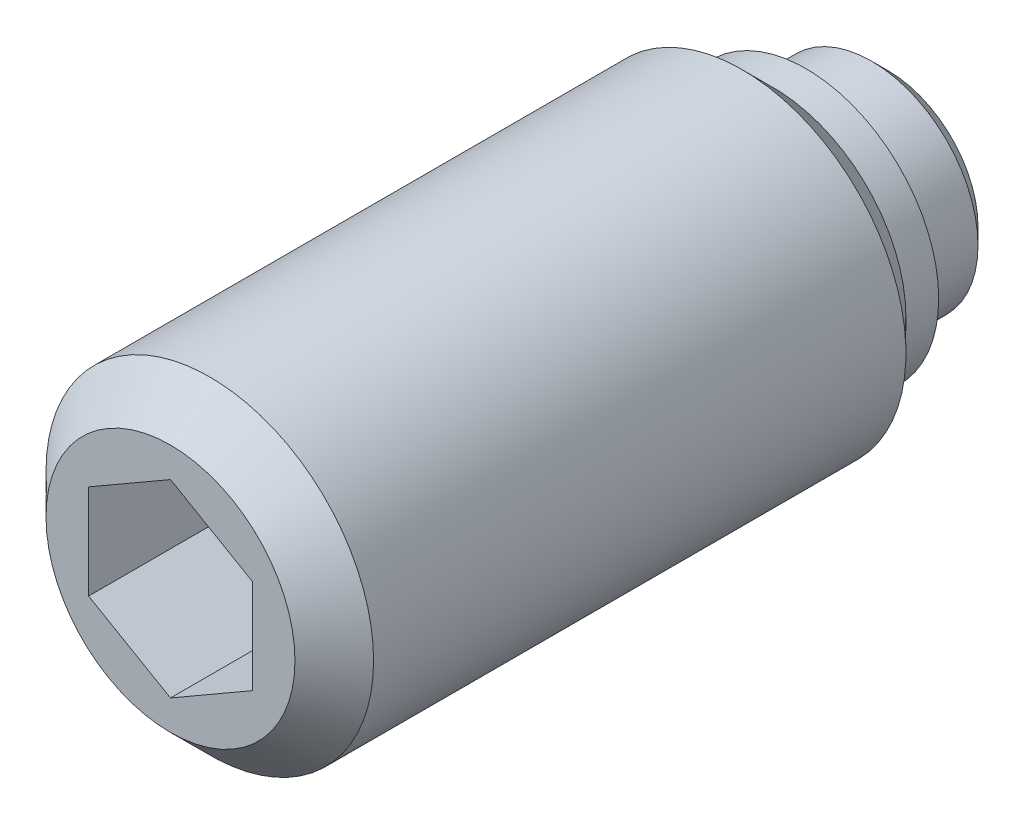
ISO-10303-21;
HEADER;
FILE_DESCRIPTION(('STEP AP214'),'2;1');
FILE_NAME('part.step','',(''),(''),'','','');
FILE_SCHEMA(('AUTOMOTIVE_DESIGN { 1 0 10303 214 1 1 1 1 }'));
ENDSEC;
DATA;
#1=APPLICATION_CONTEXT('core data for automotive mechanical design processes');
#2=APPLICATION_PROTOCOL_DEFINITION('international standard','automotive_design',2000,#1);
#3=PRODUCT_CONTEXT('',#1,'mechanical');
#4=PRODUCT('Part','Part','',(#3));
#5=PRODUCT_RELATED_PRODUCT_CATEGORY('part','',(#4));
#6=PRODUCT_DEFINITION_FORMATION('','',#4);
#7=PRODUCT_DEFINITION_CONTEXT('part definition',#1,'design');
#8=PRODUCT_DEFINITION('design','',#6,#7);
#9=PRODUCT_DEFINITION_SHAPE('','',#8);
#10=(LENGTH_UNIT() NAMED_UNIT(*) SI_UNIT(.MILLI.,.METRE.));
#11=(NAMED_UNIT(*) PLANE_ANGLE_UNIT() SI_UNIT($,.RADIAN.));
#12=(NAMED_UNIT(*) SI_UNIT($,.STERADIAN.) SOLID_ANGLE_UNIT());
#13=UNCERTAINTY_MEASURE_WITH_UNIT(LENGTH_MEASURE(1.E-05),#10,'distance_accuracy_value','');
#14=(GEOMETRIC_REPRESENTATION_CONTEXT(3) GLOBAL_UNCERTAINTY_ASSIGNED_CONTEXT((#13)) GLOBAL_UNIT_ASSIGNED_CONTEXT((#10,
#11,#12)) REPRESENTATION_CONTEXT('',''));
#15=CARTESIAN_POINT('',(0.,0.,0.));
#16=DIRECTION('',(0.,0.,1.));
#17=DIRECTION('',(1.,0.,0.));
#18=AXIS2_PLACEMENT_3D('',#15,#16,#17);
#19=CARTESIAN_POINT('',(0.,0.,0.));
#20=DIRECTION('',(0.,0.,-1.));
#21=DIRECTION('',(-1.,0.,0.));
#22=AXIS2_PLACEMENT_3D('',#19,#20,#21);
#23=CYLINDRICAL_SURFACE('',#22,3.25);
#24=CARTESIAN_POINT('',(0.,0.,0.5));
#25=DIRECTION('',(0.,0.,-1.));
#26=DIRECTION('',(-1.,0.,0.));
#27=AXIS2_PLACEMENT_3D('',#24,#25,#26);
#28=CIRCLE('',#27,3.25);
#29=CARTESIAN_POINT('',(-3.25,0.,0.5));
#30=VERTEX_POINT('',#29);
#31=EDGE_CURVE('E133',#30,#30,#28,.T.);
#32=ORIENTED_EDGE('',*,*,#31,.F.);
#33=EDGE_LOOP('',(#32));
#34=FACE_BOUND('',#33,.T.);
#35=CARTESIAN_POINT('',(0.,0.,2.5));
#36=DIRECTION('',(0.,0.,-1.));
#37=DIRECTION('',(-1.,0.,0.));
#38=AXIS2_PLACEMENT_3D('',#35,#36,#37);
#39=CIRCLE('',#38,3.25);
#40=CARTESIAN_POINT('',(-3.25,0.,2.5));
#41=VERTEX_POINT('',#40);
#42=EDGE_CURVE('E127',#41,#41,#39,.T.);
#43=ORIENTED_EDGE('',*,*,#42,.T.);
#44=EDGE_LOOP('',(#43));
#45=FACE_BOUND('',#44,.T.);
#46=ADVANCED_FACE('F14',(#34,#45),#23,.T.);
#47=CARTESIAN_POINT('',(0.,0.,0.5));
#48=DIRECTION('',(0.,0.,1.));
#49=DIRECTION('',(1.,0.,0.));
#50=AXIS2_PLACEMENT_3D('',#47,#48,#49);
#51=CONICAL_SURFACE('',#50,3.25,0.785398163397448);
#52=CARTESIAN_POINT('',(0.,0.,0.));
#53=DIRECTION('',(0.,0.,-1.));
#54=DIRECTION('',(-1.,0.,0.));
#55=AXIS2_PLACEMENT_3D('',#52,#53,#54);
#56=CIRCLE('',#55,2.75);
#57=CARTESIAN_POINT('',(-2.75,0.,0.));
#58=VERTEX_POINT('',#57);
#59=EDGE_CURVE('E130',#58,#58,#56,.T.);
#60=ORIENTED_EDGE('',*,*,#59,.F.);
#61=EDGE_LOOP('',(#60));
#62=FACE_BOUND('',#61,.T.);
#63=ORIENTED_EDGE('',*,*,#31,.T.);
#64=EDGE_LOOP('',(#63));
#65=FACE_BOUND('',#64,.T.);
#66=ADVANCED_FACE('F159',(#62,#65),#51,.T.);
#67=CARTESIAN_POINT('',(0.,2.75,0.));
#68=DIRECTION('',(0.,0.,1.));
#69=DIRECTION('',(1.,0.,0.));
#70=AXIS2_PLACEMENT_3D('',#67,#68,#69);
#71=PLANE('',#70);
#72=ORIENTED_EDGE('',*,*,#59,.T.);
#73=EDGE_LOOP('',(#72));
#74=FACE_BOUND('',#73,.T.);
#75=ADVANCED_FACE('F165',(#74),#71,.F.);
#76=CARTESIAN_POINT('',(0.,0.,2.5));
#77=DIRECTION('',(0.,0.,-1.));
#78=DIRECTION('',(-1.,0.,0.));
#79=AXIS2_PLACEMENT_3D('',#76,#77,#78);
#80=CYLINDRICAL_SURFACE('',#79,5.);
#81=CARTESIAN_POINT('',(0.,0.,4.45));
#82=DIRECTION('',(0.,0.,-1.));
#83=DIRECTION('',(-1.,0.,0.));
#84=AXIS2_PLACEMENT_3D('',#81,#82,#83);
#85=CIRCLE('',#84,5.);
#86=CARTESIAN_POINT('',(-5.,0.,4.45));
#87=VERTEX_POINT('',#86);
#88=EDGE_CURVE('E9',#87,#87,#85,.T.);
#89=ORIENTED_EDGE('',*,*,#88,.F.);
#90=EDGE_LOOP('',(#89));
#91=FACE_BOUND('',#90,.T.);
#92=CARTESIAN_POINT('',(0.,0.,20.7));
#93=DIRECTION('',(0.,0.,1.));
#94=DIRECTION('',(1.,0.,0.));
#95=AXIS2_PLACEMENT_3D('',#92,#93,#94);
#96=CIRCLE('',#95,5.);
#97=CARTESIAN_POINT('',(5.,0.,20.7));
#98=VERTEX_POINT('',#97);
#99=EDGE_CURVE('E124',#98,#98,#96,.T.);
#100=ORIENTED_EDGE('',*,*,#99,.F.);
#101=EDGE_LOOP('',(#100));
#102=FACE_BOUND('',#101,.T.);
#103=ADVANCED_FACE('F16',(#91,#102),#80,.T.);
#104=CARTESIAN_POINT('',(0.,4.05,2.5));
#105=DIRECTION('',(0.,0.,1.));
#106=DIRECTION('',(1.,0.,0.));
#107=AXIS2_PLACEMENT_3D('',#104,#105,#106);
#108=PLANE('',#107);
#109=CARTESIAN_POINT('',(0.,0.,2.5));
#110=DIRECTION('',(0.,0.,-1.));
#111=DIRECTION('',(-1.,0.,0.));
#112=AXIS2_PLACEMENT_3D('',#109,#110,#111);
#113=CIRCLE('',#112,4.05);
#114=CARTESIAN_POINT('',(-4.05,0.,2.5));
#115=VERTEX_POINT('',#114);
#116=EDGE_CURVE('E136',#115,#115,#113,.T.);
#117=ORIENTED_EDGE('',*,*,#116,.T.);
#118=EDGE_LOOP('',(#117));
#119=FACE_BOUND('',#118,.T.);
#120=ORIENTED_EDGE('',*,*,#42,.F.);
#121=EDGE_LOOP('',(#120));
#122=FACE_BOUND('',#121,.T.);
#123=ADVANCED_FACE('F156',(#119,#122),#108,.F.);
#124=CARTESIAN_POINT('',(0.,0.,2.5));
#125=DIRECTION('',(0.,0.,-1.));
#126=DIRECTION('',(-1.,0.,0.));
#127=AXIS2_PLACEMENT_3D('',#124,#125,#126);
#128=CYLINDRICAL_SURFACE('',#127,4.05);
#129=CARTESIAN_POINT('',(0.,0.,3.5));
#130=DIRECTION('',(0.,0.,-1.));
#131=DIRECTION('',(-1.,0.,0.));
#132=AXIS2_PLACEMENT_3D('',#129,#130,#131);
#133=CIRCLE('',#132,4.05);
#134=CARTESIAN_POINT('',(-4.05,0.,3.5));
#135=VERTEX_POINT('',#134);
#136=EDGE_CURVE('E22',#135,#135,#133,.T.);
#137=ORIENTED_EDGE('',*,*,#136,.T.);
#138=EDGE_LOOP('',(#137));
#139=FACE_BOUND('',#138,.T.);
#140=ORIENTED_EDGE('',*,*,#116,.F.);
#141=EDGE_LOOP('',(#140));
#142=FACE_BOUND('',#141,.T.);
#143=ADVANCED_FACE('F141',(#139,#142),#128,.T.);
#144=CARTESIAN_POINT('',(0.,0.,4.45));
#145=DIRECTION('',(0.,0.,1.));
#146=DIRECTION('',(1.,0.,0.));
#147=AXIS2_PLACEMENT_3D('',#144,#145,#146);
#148=CONICAL_SURFACE('',#147,5.,0.785398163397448);
#149=ORIENTED_EDGE('',*,*,#88,.T.);
#150=EDGE_LOOP('',(#149));
#151=FACE_BOUND('',#150,.T.);
#152=ORIENTED_EDGE('',*,*,#136,.F.);
#153=EDGE_LOOP('',(#152));
#154=FACE_BOUND('',#153,.T.);
#155=ADVANCED_FACE('F144',(#151,#154),#148,.T.);
#156=CARTESIAN_POINT('',(0.,-3.8,21.9));
#157=DIRECTION('',(0.,0.,1.));
#158=DIRECTION('',(1.,0.,0.));
#159=AXIS2_PLACEMENT_3D('',#156,#157,#158);
#160=PLANE('',#159);
#161=DIRECTION('',(0.866025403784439,-0.5,0.));
#162=VECTOR('',#161,1.);
#163=CARTESIAN_POINT('',(-2.5,-1.44337567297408,21.9));
#164=LINE('',#163,#162);
#165=CARTESIAN_POINT('',(-2.5,-1.44337567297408,21.9));
#166=VERTEX_POINT('',#165);
#167=CARTESIAN_POINT('',(0.,-2.88675134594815,21.9));
#168=VERTEX_POINT('',#167);
#169=EDGE_CURVE('E29',#166,#168,#164,.T.);
#170=ORIENTED_EDGE('',*,*,#169,.F.);
#171=DIRECTION('',(0.,-1.,0.));
#172=VECTOR('',#171,1.);
#173=CARTESIAN_POINT('',(-2.5,1.44337567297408,21.9));
#174=LINE('',#173,#172);
#175=CARTESIAN_POINT('',(-2.5,1.44337567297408,21.9));
#176=VERTEX_POINT('',#175);
#177=EDGE_CURVE('E112',#176,#166,#174,.T.);
#178=ORIENTED_EDGE('',*,*,#177,.F.);
#179=DIRECTION('',(-0.866025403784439,-0.5,0.));
#180=VECTOR('',#179,1.);
#181=CARTESIAN_POINT('',(0.,2.88675134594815,21.9));
#182=LINE('',#181,#180);
#183=CARTESIAN_POINT('',(0.,2.88675134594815,21.9));
#184=VERTEX_POINT('',#183);
#185=EDGE_CURVE('E110',#184,#176,#182,.T.);
#186=ORIENTED_EDGE('',*,*,#185,.F.);
#187=DIRECTION('',(-0.866025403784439,0.5,0.));
#188=VECTOR('',#187,1.);
#189=CARTESIAN_POINT('',(2.5,1.44337567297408,21.9));
#190=LINE('',#189,#188);
#191=CARTESIAN_POINT('',(2.5,1.44337567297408,21.9));
#192=VERTEX_POINT('',#191);
#193=EDGE_CURVE('E77',#192,#184,#190,.T.);
#194=ORIENTED_EDGE('',*,*,#193,.F.);
#195=DIRECTION('',(0.,1.,0.));
#196=VECTOR('',#195,1.);
#197=CARTESIAN_POINT('',(2.5,-1.44337567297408,21.9));
#198=LINE('',#197,#196);
#199=CARTESIAN_POINT('',(2.5,-1.44337567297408,21.9));
#200=VERTEX_POINT('',#199);
#201=EDGE_CURVE('E106',#200,#192,#198,.T.);
#202=ORIENTED_EDGE('',*,*,#201,.F.);
#203=DIRECTION('',(0.866025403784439,0.5,0.));
#204=VECTOR('',#203,1.);
#205=CARTESIAN_POINT('',(0.,-2.88675134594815,21.9));
#206=LINE('',#205,#204);
#207=EDGE_CURVE('E103',#168,#200,#206,.T.);
#208=ORIENTED_EDGE('',*,*,#207,.F.);
#209=EDGE_LOOP('',(#170,#178,#186,#194,#202,#208));
#210=FACE_BOUND('',#209,.T.);
#211=CARTESIAN_POINT('',(0.,0.,21.9));
#212=DIRECTION('',(0.,0.,1.));
#213=DIRECTION('',(1.,0.,0.));
#214=AXIS2_PLACEMENT_3D('',#211,#212,#213);
#215=CIRCLE('',#214,3.8);
#216=CARTESIAN_POINT('',(3.8,0.,21.9));
#217=VERTEX_POINT('',#216);
#218=EDGE_CURVE('E116',#217,#217,#215,.T.);
#219=ORIENTED_EDGE('',*,*,#218,.T.);
#220=EDGE_LOOP('',(#219));
#221=FACE_BOUND('',#220,.T.);
#222=ADVANCED_FACE('F146',(#210,#221),#160,.T.);
#223=CARTESIAN_POINT('',(0.,0.,21.9));
#224=DIRECTION('',(0.,0.,-1.));
#225=DIRECTION('',(-1.,0.,0.));
#226=AXIS2_PLACEMENT_3D('',#223,#224,#225);
#227=CONICAL_SURFACE('',#226,3.8,0.78539816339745);
#228=ORIENTED_EDGE('',*,*,#99,.T.);
#229=EDGE_LOOP('',(#228));
#230=FACE_BOUND('',#229,.T.);
#231=ORIENTED_EDGE('',*,*,#218,.F.);
#232=EDGE_LOOP('',(#231));
#233=FACE_BOUND('',#232,.T.);
#234=ADVANCED_FACE('F153',(#230,#233),#227,.T.);
#235=CARTESIAN_POINT('',(-2.5,-1.44337567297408,15.9));
#236=DIRECTION('',(-0.5,-0.866025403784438,0.));
#237=DIRECTION('',(0.866025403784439,-0.5,0.));
#238=AXIS2_PLACEMENT_3D('',#235,#236,#237);
#239=PLANE('',#238);
#240=ORIENTED_EDGE('',*,*,#169,.T.);
#241=DIRECTION('',(0.,0.,1.));
#242=VECTOR('',#241,1.);
#243=CARTESIAN_POINT('',(0.,-2.88675134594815,15.9));
#244=LINE('',#243,#242);
#245=CARTESIAN_POINT('',(0.,-2.88675134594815,15.9));
#246=VERTEX_POINT('',#245);
#247=EDGE_CURVE('E59',#246,#168,#244,.T.);
#248=ORIENTED_EDGE('',*,*,#247,.F.);
#249=DIRECTION('',(0.866025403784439,-0.5,0.));
#250=VECTOR('',#249,1.);
#251=CARTESIAN_POINT('',(-2.5,-1.44337567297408,15.9));
#252=LINE('',#251,#250);
#253=CARTESIAN_POINT('',(-2.5,-1.44337567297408,15.9));
#254=VERTEX_POINT('',#253);
#255=EDGE_CURVE('E114',#254,#246,#252,.T.);
#256=ORIENTED_EDGE('',*,*,#255,.F.);
#257=DIRECTION('',(0.,0.,1.));
#258=VECTOR('',#257,1.);
#259=CARTESIAN_POINT('',(-2.5,-1.44337567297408,15.9));
#260=LINE('',#259,#258);
#261=EDGE_CURVE('E37',#254,#166,#260,.T.);
#262=ORIENTED_EDGE('',*,*,#261,.T.);
#263=EDGE_LOOP('',(#240,#248,#256,#262));
#264=FACE_BOUND('',#263,.T.);
#265=ADVANCED_FACE('F191',(#264),#239,.F.);
#266=CARTESIAN_POINT('',(-2.5,1.44337567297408,15.9));
#267=DIRECTION('',(-1.,0.,0.));
#268=DIRECTION('',(0.,0.,1.));
#269=AXIS2_PLACEMENT_3D('',#266,#267,#268);
#270=PLANE('',#269);
#271=ORIENTED_EDGE('',*,*,#177,.T.);
#272=ORIENTED_EDGE('',*,*,#261,.F.);
#273=DIRECTION('',(0.,-1.,0.));
#274=VECTOR('',#273,1.);
#275=CARTESIAN_POINT('',(-2.5,1.44337567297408,15.9));
#276=LINE('',#275,#274);
#277=CARTESIAN_POINT('',(-2.5,1.44337567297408,15.9));
#278=VERTEX_POINT('',#277);
#279=EDGE_CURVE('E89',#278,#254,#276,.T.);
#280=ORIENTED_EDGE('',*,*,#279,.F.);
#281=DIRECTION('',(0.,0.,1.));
#282=VECTOR('',#281,1.);
#283=CARTESIAN_POINT('',(-2.5,1.44337567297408,15.9));
#284=LINE('',#283,#282);
#285=EDGE_CURVE('E81',#278,#176,#284,.T.);
#286=ORIENTED_EDGE('',*,*,#285,.T.);
#287=EDGE_LOOP('',(#271,#272,#280,#286));
#288=FACE_BOUND('',#287,.T.);
#289=ADVANCED_FACE('F198',(#288),#270,.F.);
#290=CARTESIAN_POINT('',(0.,2.88675134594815,15.9));
#291=DIRECTION('',(-0.5,0.866025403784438,0.));
#292=DIRECTION('',(-0.866025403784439,-0.5,0.));
#293=AXIS2_PLACEMENT_3D('',#290,#291,#292);
#294=PLANE('',#293);
#295=ORIENTED_EDGE('',*,*,#185,.T.);
#296=ORIENTED_EDGE('',*,*,#285,.F.);
#297=DIRECTION('',(-0.866025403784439,-0.5,0.));
#298=VECTOR('',#297,1.);
#299=CARTESIAN_POINT('',(0.,2.88675134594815,15.9));
#300=LINE('',#299,#298);
#301=CARTESIAN_POINT('',(0.,2.88675134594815,15.9));
#302=VERTEX_POINT('',#301);
#303=EDGE_CURVE('E85',#302,#278,#300,.T.);
#304=ORIENTED_EDGE('',*,*,#303,.F.);
#305=DIRECTION('',(0.,0.,1.));
#306=VECTOR('',#305,1.);
#307=CARTESIAN_POINT('',(0.,2.88675134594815,15.9));
#308=LINE('',#307,#306);
#309=EDGE_CURVE('E70',#302,#184,#308,.T.);
#310=ORIENTED_EDGE('',*,*,#309,.T.);
#311=EDGE_LOOP('',(#295,#296,#304,#310));
#312=FACE_BOUND('',#311,.T.);
#313=ADVANCED_FACE('F86',(#312),#294,.F.);
#314=CARTESIAN_POINT('',(2.5,1.44337567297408,15.9));
#315=DIRECTION('',(0.5,0.866025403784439,0.));
#316=DIRECTION('',(-0.866025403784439,0.5,0.));
#317=AXIS2_PLACEMENT_3D('',#314,#315,#316);
#318=PLANE('',#317);
#319=ORIENTED_EDGE('',*,*,#193,.T.);
#320=ORIENTED_EDGE('',*,*,#309,.F.);
#321=DIRECTION('',(-0.866025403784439,0.5,0.));
#322=VECTOR('',#321,1.);
#323=CARTESIAN_POINT('',(2.5,1.44337567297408,15.9));
#324=LINE('',#323,#322);
#325=CARTESIAN_POINT('',(2.5,1.44337567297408,15.9));
#326=VERTEX_POINT('',#325);
#327=EDGE_CURVE('E74',#326,#302,#324,.T.);
#328=ORIENTED_EDGE('',*,*,#327,.F.);
#329=DIRECTION('',(0.,0.,1.));
#330=VECTOR('',#329,1.);
#331=CARTESIAN_POINT('',(2.5,1.44337567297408,15.9));
#332=LINE('',#331,#330);
#333=EDGE_CURVE('E82',#326,#192,#332,.T.);
#334=ORIENTED_EDGE('',*,*,#333,.T.);
#335=EDGE_LOOP('',(#319,#320,#328,#334));
#336=FACE_BOUND('',#335,.T.);
#337=ADVANCED_FACE('F72',(#336),#318,.F.);
#338=CARTESIAN_POINT('',(2.5,-1.44337567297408,15.9));
#339=DIRECTION('',(1.,0.,0.));
#340=DIRECTION('',(0.,1.,0.));
#341=AXIS2_PLACEMENT_3D('',#338,#339,#340);
#342=PLANE('',#341);
#343=ORIENTED_EDGE('',*,*,#201,.T.);
#344=ORIENTED_EDGE('',*,*,#333,.F.);
#345=DIRECTION('',(0.,1.,0.));
#346=VECTOR('',#345,1.);
#347=CARTESIAN_POINT('',(2.5,-1.44337567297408,15.9));
#348=LINE('',#347,#346);
#349=CARTESIAN_POINT('',(2.5,-1.44337567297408,15.9));
#350=VERTEX_POINT('',#349);
#351=EDGE_CURVE('E95',#350,#326,#348,.T.);
#352=ORIENTED_EDGE('',*,*,#351,.F.);
#353=DIRECTION('',(0.,0.,1.));
#354=VECTOR('',#353,1.);
#355=CARTESIAN_POINT('',(2.5,-1.44337567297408,15.9));
#356=LINE('',#355,#354);
#357=EDGE_CURVE('E119',#350,#200,#356,.T.);
#358=ORIENTED_EDGE('',*,*,#357,.T.);
#359=EDGE_LOOP('',(#343,#344,#352,#358));
#360=FACE_BOUND('',#359,.T.);
#361=ADVANCED_FACE('F204',(#360),#342,.F.);
#362=CARTESIAN_POINT('',(0.,-2.88675134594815,15.9));
#363=DIRECTION('',(0.5,-0.866025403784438,0.));
#364=DIRECTION('',(0.866025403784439,0.5,0.));
#365=AXIS2_PLACEMENT_3D('',#362,#363,#364);
#366=PLANE('',#365);
#367=ORIENTED_EDGE('',*,*,#207,.T.);
#368=ORIENTED_EDGE('',*,*,#357,.F.);
#369=DIRECTION('',(0.866025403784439,0.5,0.));
#370=VECTOR('',#369,1.);
#371=CARTESIAN_POINT('',(0.,-2.88675134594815,15.9));
#372=LINE('',#371,#370);
#373=EDGE_CURVE('E97',#246,#350,#372,.T.);
#374=ORIENTED_EDGE('',*,*,#373,.F.);
#375=ORIENTED_EDGE('',*,*,#247,.T.);
#376=EDGE_LOOP('',(#367,#368,#374,#375));
#377=FACE_BOUND('',#376,.T.);
#378=ADVANCED_FACE('F201',(#377),#366,.F.);
#379=CARTESIAN_POINT('',(0.,0.,15.9));
#380=DIRECTION('',(0.,0.,1.));
#381=DIRECTION('',(1.,0.,0.));
#382=AXIS2_PLACEMENT_3D('',#379,#380,#381);
#383=PLANE('',#382);
#384=ORIENTED_EDGE('',*,*,#255,.T.);
#385=ORIENTED_EDGE('',*,*,#373,.T.);
#386=ORIENTED_EDGE('',*,*,#351,.T.);
#387=ORIENTED_EDGE('',*,*,#327,.T.);
#388=ORIENTED_EDGE('',*,*,#303,.T.);
#389=ORIENTED_EDGE('',*,*,#279,.T.);
#390=EDGE_LOOP('',(#384,#385,#386,#387,#388,#389));
#391=FACE_BOUND('',#390,.T.);
#392=ADVANCED_FACE('F92',(#391),#383,.T.);
#393=CLOSED_SHELL('',(#46,#66,#75,#103,#123,#143,#155,#222,#234,#265,#289,#313,#337,#361,#378,#392));
#394=MANIFOLD_SOLID_BREP('B1',#393);
#395=ADVANCED_BREP_SHAPE_REPRESENTATION('',(#18,#394),#14);
#396=SHAPE_DEFINITION_REPRESENTATION(#9,#395);
ENDSEC;
END-ISO-10303-21;
